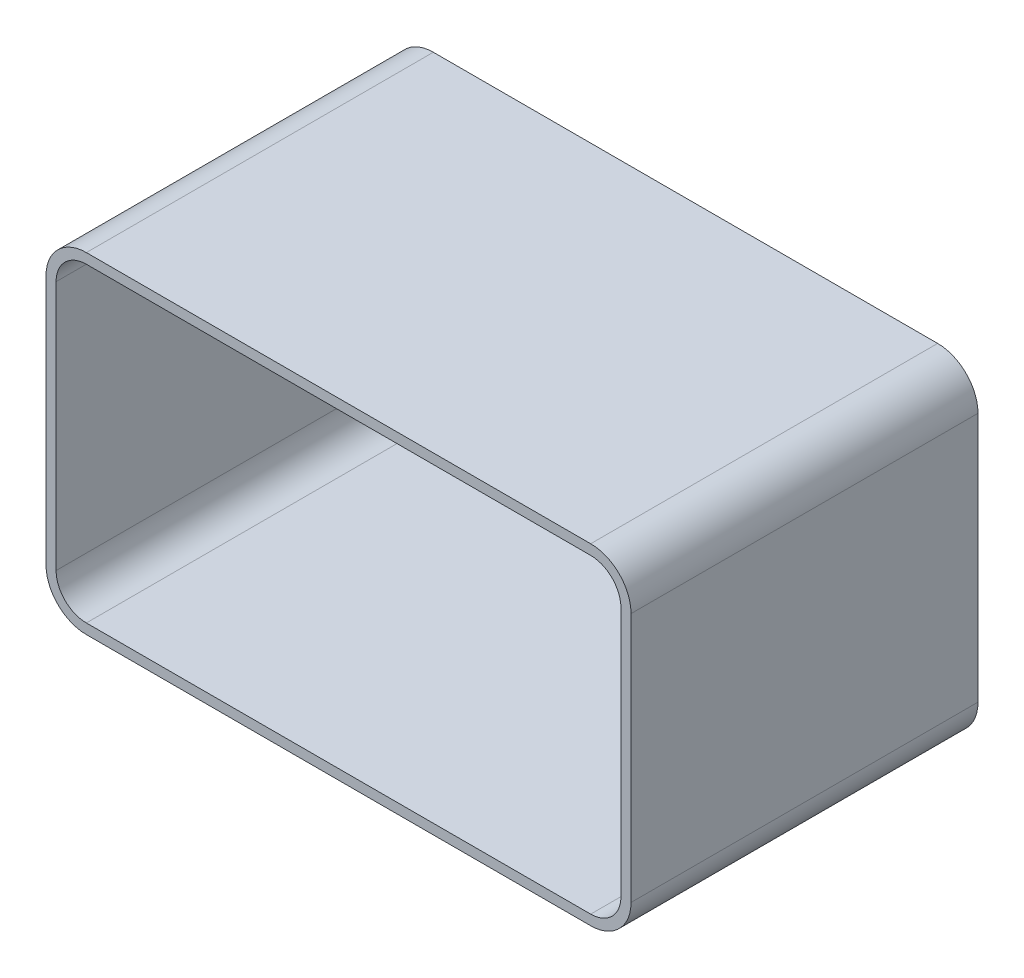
ISO-10303-21;
HEADER;
FILE_DESCRIPTION(('STEP AP214'),'2;1');
FILE_NAME('part.step','',(''),(''),'','','');
FILE_SCHEMA(('AUTOMOTIVE_DESIGN { 1 0 10303 214 1 1 1 1 }'));
ENDSEC;
DATA;
#1=APPLICATION_CONTEXT('core data for automotive mechanical design processes');
#2=APPLICATION_PROTOCOL_DEFINITION('international standard','automotive_design',2000,#1);
#3=PRODUCT_CONTEXT('',#1,'mechanical');
#4=PRODUCT('Part','Part','',(#3));
#5=PRODUCT_RELATED_PRODUCT_CATEGORY('part','',(#4));
#6=PRODUCT_DEFINITION_FORMATION('','',#4);
#7=PRODUCT_DEFINITION_CONTEXT('part definition',#1,'design');
#8=PRODUCT_DEFINITION('design','',#6,#7);
#9=PRODUCT_DEFINITION_SHAPE('','',#8);
#10=(LENGTH_UNIT() NAMED_UNIT(*) SI_UNIT(.MILLI.,.METRE.));
#11=(NAMED_UNIT(*) PLANE_ANGLE_UNIT() SI_UNIT($,.RADIAN.));
#12=(NAMED_UNIT(*) SI_UNIT($,.STERADIAN.) SOLID_ANGLE_UNIT());
#13=UNCERTAINTY_MEASURE_WITH_UNIT(LENGTH_MEASURE(1.E-05),#10,'distance_accuracy_value','');
#14=(GEOMETRIC_REPRESENTATION_CONTEXT(3) GLOBAL_UNCERTAINTY_ASSIGNED_CONTEXT((#13)) GLOBAL_UNIT_ASSIGNED_CONTEXT((#10,
#11,#12)) REPRESENTATION_CONTEXT('',''));
#15=CARTESIAN_POINT('',(0.,0.,0.));
#16=DIRECTION('',(0.,0.,1.));
#17=DIRECTION('',(1.,0.,0.));
#18=AXIS2_PLACEMENT_3D('',#15,#16,#17);
#19=CARTESIAN_POINT('',(0.,164.,0.));
#20=DIRECTION('',(0.,0.,-1.));
#21=DIRECTION('',(-1.,0.,0.));
#22=AXIS2_PLACEMENT_3D('',#19,#20,#21);
#23=PLANE('',#22);
#24=DIRECTION('',(-1.,0.,0.));
#25=VECTOR('',#24,1.);
#26=CARTESIAN_POINT('',(0.,164.,0.));
#27=LINE('',#26,#25);
#28=CARTESIAN_POINT('',(270.,164.,0.));
#29=VERTEX_POINT('',#28);
#30=CARTESIAN_POINT('',(20.,164.,0.));
#31=VERTEX_POINT('',#30);
#32=EDGE_CURVE('E227',#29,#31,#27,.T.);
#33=ORIENTED_EDGE('',*,*,#32,.T.);
#34=CARTESIAN_POINT('',(20.,144.,0.));
#35=DIRECTION('',(0.,0.,-1.));
#36=DIRECTION('',(-1.,0.,0.));
#37=AXIS2_PLACEMENT_3D('',#34,#35,#36);
#38=CIRCLE('',#37,20.);
#39=CARTESIAN_POINT('',(0.,144.,0.));
#40=VERTEX_POINT('',#39);
#41=EDGE_CURVE('E256',#31,#40,#38,.F.);
#42=ORIENTED_EDGE('',*,*,#41,.T.);
#43=DIRECTION('',(0.,-1.,0.));
#44=VECTOR('',#43,1.);
#45=CARTESIAN_POINT('',(0.,0.,0.));
#46=LINE('',#45,#44);
#47=CARTESIAN_POINT('',(0.,20.,0.));
#48=VERTEX_POINT('',#47);
#49=EDGE_CURVE('E206',#40,#48,#46,.T.);
#50=ORIENTED_EDGE('',*,*,#49,.T.);
#51=CARTESIAN_POINT('',(20.,20.,0.));
#52=DIRECTION('',(0.,0.,-1.));
#53=DIRECTION('',(-1.,0.,0.));
#54=AXIS2_PLACEMENT_3D('',#51,#52,#53);
#55=CIRCLE('',#54,20.);
#56=CARTESIAN_POINT('',(20.,0.,0.));
#57=VERTEX_POINT('',#56);
#58=EDGE_CURVE('E254',#48,#57,#55,.F.);
#59=ORIENTED_EDGE('',*,*,#58,.T.);
#60=DIRECTION('',(1.,0.,0.));
#61=VECTOR('',#60,1.);
#62=CARTESIAN_POINT('',(0.,0.,0.));
#63=LINE('',#62,#61);
#64=CARTESIAN_POINT('',(270.,0.,0.));
#65=VERTEX_POINT('',#64);
#66=EDGE_CURVE('E238',#57,#65,#63,.T.);
#67=ORIENTED_EDGE('',*,*,#66,.T.);
#68=CARTESIAN_POINT('',(270.,20.,0.));
#69=DIRECTION('',(0.,0.,-1.));
#70=DIRECTION('',(-1.,0.,0.));
#71=AXIS2_PLACEMENT_3D('',#68,#69,#70);
#72=CIRCLE('',#71,20.);
#73=CARTESIAN_POINT('',(290.,20.,0.));
#74=VERTEX_POINT('',#73);
#75=EDGE_CURVE('E252',#65,#74,#72,.F.);
#76=ORIENTED_EDGE('',*,*,#75,.T.);
#77=DIRECTION('',(0.,1.,0.));
#78=VECTOR('',#77,1.);
#79=CARTESIAN_POINT('',(290.,0.,0.));
#80=LINE('',#79,#78);
#81=CARTESIAN_POINT('',(290.,144.,0.));
#82=VERTEX_POINT('',#81);
#83=EDGE_CURVE('E241',#74,#82,#80,.T.);
#84=ORIENTED_EDGE('',*,*,#83,.T.);
#85=CARTESIAN_POINT('',(270.,144.,0.));
#86=DIRECTION('',(0.,0.,-1.));
#87=DIRECTION('',(-1.,0.,0.));
#88=AXIS2_PLACEMENT_3D('',#85,#86,#87);
#89=CIRCLE('',#88,20.);
#90=EDGE_CURVE('E250',#82,#29,#89,.F.);
#91=ORIENTED_EDGE('',*,*,#90,.T.);
#92=EDGE_LOOP('',(#33,#42,#50,#59,#67,#76,#84,#91));
#93=FACE_BOUND('',#92,.T.);
#94=DIRECTION('',(-1.,0.,0.));
#95=VECTOR('',#94,1.);
#96=CARTESIAN_POINT('',(0.,159.,0.));
#97=LINE('',#96,#95);
#98=CARTESIAN_POINT('',(270.,159.,0.));
#99=VERTEX_POINT('',#98);
#100=CARTESIAN_POINT('',(20.,159.,0.));
#101=VERTEX_POINT('',#100);
#102=EDGE_CURVE('E174',#99,#101,#97,.T.);
#103=ORIENTED_EDGE('',*,*,#102,.F.);
#104=CARTESIAN_POINT('',(270.,144.,0.));
#105=DIRECTION('',(0.,0.,-1.));
#106=DIRECTION('',(-1.,0.,0.));
#107=AXIS2_PLACEMENT_3D('',#104,#105,#106);
#108=CIRCLE('',#107,15.);
#109=CARTESIAN_POINT('',(285.,144.,0.));
#110=VERTEX_POINT('',#109);
#111=EDGE_CURVE('E201',#110,#99,#108,.F.);
#112=ORIENTED_EDGE('',*,*,#111,.F.);
#113=DIRECTION('',(0.,1.,0.));
#114=VECTOR('',#113,1.);
#115=CARTESIAN_POINT('',(285.,0.,0.));
#116=LINE('',#115,#114);
#117=CARTESIAN_POINT('',(285.,20.,0.));
#118=VERTEX_POINT('',#117);
#119=EDGE_CURVE('E53',#118,#110,#116,.T.);
#120=ORIENTED_EDGE('',*,*,#119,.F.);
#121=CARTESIAN_POINT('',(270.,20.,0.));
#122=DIRECTION('',(0.,0.,-1.));
#123=DIRECTION('',(-1.,0.,0.));
#124=AXIS2_PLACEMENT_3D('',#121,#122,#123);
#125=CIRCLE('',#124,15.);
#126=CARTESIAN_POINT('',(270.,5.,0.));
#127=VERTEX_POINT('',#126);
#128=EDGE_CURVE('E214',#127,#118,#125,.F.);
#129=ORIENTED_EDGE('',*,*,#128,.F.);
#130=DIRECTION('',(1.,0.,0.));
#131=VECTOR('',#130,1.);
#132=CARTESIAN_POINT('',(0.,5.,0.));
#133=LINE('',#132,#131);
#134=CARTESIAN_POINT('',(20.,5.,0.));
#135=VERTEX_POINT('',#134);
#136=EDGE_CURVE('E211',#135,#127,#133,.T.);
#137=ORIENTED_EDGE('',*,*,#136,.F.);
#138=CARTESIAN_POINT('',(20.,20.,0.));
#139=DIRECTION('',(0.,0.,-1.));
#140=DIRECTION('',(-1.,0.,0.));
#141=AXIS2_PLACEMENT_3D('',#138,#139,#140);
#142=CIRCLE('',#141,15.);
#143=CARTESIAN_POINT('',(5.,20.,0.));
#144=VERTEX_POINT('',#143);
#145=EDGE_CURVE('E212',#144,#135,#142,.F.);
#146=ORIENTED_EDGE('',*,*,#145,.F.);
#147=DIRECTION('',(0.,-1.,0.));
#148=VECTOR('',#147,1.);
#149=CARTESIAN_POINT('',(5.,0.,0.));
#150=LINE('',#149,#148);
#151=CARTESIAN_POINT('',(5.,144.,0.));
#152=VERTEX_POINT('',#151);
#153=EDGE_CURVE('E209',#152,#144,#150,.T.);
#154=ORIENTED_EDGE('',*,*,#153,.F.);
#155=CARTESIAN_POINT('',(20.,144.,0.));
#156=DIRECTION('',(0.,0.,-1.));
#157=DIRECTION('',(-1.,0.,0.));
#158=AXIS2_PLACEMENT_3D('',#155,#156,#157);
#159=CIRCLE('',#158,15.);
#160=EDGE_CURVE('E160',#101,#152,#159,.F.);
#161=ORIENTED_EDGE('',*,*,#160,.F.);
#162=EDGE_LOOP('',(#103,#112,#120,#129,#137,#146,#154,#161));
#163=FACE_BOUND('',#162,.T.);
#164=ADVANCED_FACE('F38',(#93,#163),#23,.F.);
#165=CARTESIAN_POINT('',(0.,0.,-172.));
#166=DIRECTION('',(-1.,0.,0.));
#167=DIRECTION('',(0.,0.,1.));
#168=AXIS2_PLACEMENT_3D('',#165,#166,#167);
#169=PLANE('',#168);
#170=ORIENTED_EDGE('',*,*,#49,.F.);
#171=DIRECTION('',(0.,0.,1.));
#172=VECTOR('',#171,1.);
#173=CARTESIAN_POINT('',(0.,144.,-172.));
#174=LINE('',#173,#172);
#175=CARTESIAN_POINT('',(0.,144.,-172.));
#176=VERTEX_POINT('',#175);
#177=EDGE_CURVE('E261',#40,#176,#174,.F.);
#178=ORIENTED_EDGE('',*,*,#177,.T.);
#179=DIRECTION('',(0.,-1.,0.));
#180=VECTOR('',#179,1.);
#181=CARTESIAN_POINT('',(0.,0.,-172.));
#182=LINE('',#181,#180);
#183=CARTESIAN_POINT('',(0.,20.,-172.));
#184=VERTEX_POINT('',#183);
#185=EDGE_CURVE('E223',#176,#184,#182,.T.);
#186=ORIENTED_EDGE('',*,*,#185,.T.);
#187=DIRECTION('',(0.,0.,1.));
#188=VECTOR('',#187,1.);
#189=CARTESIAN_POINT('',(0.,20.,-172.));
#190=LINE('',#189,#188);
#191=EDGE_CURVE('E258',#184,#48,#190,.T.);
#192=ORIENTED_EDGE('',*,*,#191,.T.);
#193=EDGE_LOOP('',(#170,#178,#186,#192));
#194=FACE_BOUND('',#193,.T.);
#195=ADVANCED_FACE('F300',(#194),#169,.T.);
#196=CARTESIAN_POINT('',(0.,164.,-172.));
#197=DIRECTION('',(0.,1.,0.));
#198=DIRECTION('',(0.,0.,1.));
#199=AXIS2_PLACEMENT_3D('',#196,#197,#198);
#200=PLANE('',#199);
#201=DIRECTION('',(-1.,0.,0.));
#202=VECTOR('',#201,1.);
#203=CARTESIAN_POINT('',(0.,164.,-172.));
#204=LINE('',#203,#202);
#205=CARTESIAN_POINT('',(270.,164.,-172.));
#206=VERTEX_POINT('',#205);
#207=CARTESIAN_POINT('',(20.,164.,-172.));
#208=VERTEX_POINT('',#207);
#209=EDGE_CURVE('E232',#206,#208,#204,.T.);
#210=ORIENTED_EDGE('',*,*,#209,.T.);
#211=DIRECTION('',(0.,0.,1.));
#212=VECTOR('',#211,1.);
#213=CARTESIAN_POINT('',(20.,164.,-172.));
#214=LINE('',#213,#212);
#215=EDGE_CURVE('E247',#208,#31,#214,.T.);
#216=ORIENTED_EDGE('',*,*,#215,.T.);
#217=ORIENTED_EDGE('',*,*,#32,.F.);
#218=DIRECTION('',(0.,0.,1.));
#219=VECTOR('',#218,1.);
#220=CARTESIAN_POINT('',(270.,164.,-172.));
#221=LINE('',#220,#219);
#222=EDGE_CURVE('E235',#29,#206,#221,.F.);
#223=ORIENTED_EDGE('',*,*,#222,.T.);
#224=EDGE_LOOP('',(#210,#216,#217,#223));
#225=FACE_BOUND('',#224,.T.);
#226=ADVANCED_FACE('F307',(#225),#200,.T.);
#227=CARTESIAN_POINT('',(290.,0.,-172.));
#228=DIRECTION('',(1.,0.,0.));
#229=DIRECTION('',(0.,0.,-1.));
#230=AXIS2_PLACEMENT_3D('',#227,#228,#229);
#231=PLANE('',#230);
#232=ORIENTED_EDGE('',*,*,#83,.F.);
#233=DIRECTION('',(0.,0.,1.));
#234=VECTOR('',#233,1.);
#235=CARTESIAN_POINT('',(290.,20.,-172.));
#236=LINE('',#235,#234);
#237=CARTESIAN_POINT('',(290.,20.,-172.));
#238=VERTEX_POINT('',#237);
#239=EDGE_CURVE('E11',#74,#238,#236,.F.);
#240=ORIENTED_EDGE('',*,*,#239,.T.);
#241=DIRECTION('',(0.,1.,0.));
#242=VECTOR('',#241,1.);
#243=CARTESIAN_POINT('',(290.,0.,-172.));
#244=LINE('',#243,#242);
#245=CARTESIAN_POINT('',(290.,144.,-172.));
#246=VERTEX_POINT('',#245);
#247=EDGE_CURVE('E229',#238,#246,#244,.T.);
#248=ORIENTED_EDGE('',*,*,#247,.T.);
#249=DIRECTION('',(0.,0.,1.));
#250=VECTOR('',#249,1.);
#251=CARTESIAN_POINT('',(290.,144.,-172.));
#252=LINE('',#251,#250);
#253=EDGE_CURVE('E46',#246,#82,#252,.T.);
#254=ORIENTED_EDGE('',*,*,#253,.T.);
#255=EDGE_LOOP('',(#232,#240,#248,#254));
#256=FACE_BOUND('',#255,.T.);
#257=ADVANCED_FACE('F278',(#256),#231,.T.);
#258=CARTESIAN_POINT('',(0.,0.,-172.));
#259=DIRECTION('',(0.,-1.,0.));
#260=DIRECTION('',(0.,0.,-1.));
#261=AXIS2_PLACEMENT_3D('',#258,#259,#260);
#262=PLANE('',#261);
#263=ORIENTED_EDGE('',*,*,#66,.F.);
#264=DIRECTION('',(0.,0.,1.));
#265=VECTOR('',#264,1.);
#266=CARTESIAN_POINT('',(20.,0.,-172.));
#267=LINE('',#266,#265);
#268=CARTESIAN_POINT('',(20.,0.,-172.));
#269=VERTEX_POINT('',#268);
#270=EDGE_CURVE('E273',#57,#269,#267,.F.);
#271=ORIENTED_EDGE('',*,*,#270,.T.);
#272=DIRECTION('',(1.,0.,0.));
#273=VECTOR('',#272,1.);
#274=CARTESIAN_POINT('',(0.,0.,-172.));
#275=LINE('',#274,#273);
#276=CARTESIAN_POINT('',(270.,0.,-172.));
#277=VERTEX_POINT('',#276);
#278=EDGE_CURVE('E226',#269,#277,#275,.T.);
#279=ORIENTED_EDGE('',*,*,#278,.T.);
#280=DIRECTION('',(0.,0.,1.));
#281=VECTOR('',#280,1.);
#282=CARTESIAN_POINT('',(270.,0.,-172.));
#283=LINE('',#282,#281);
#284=EDGE_CURVE('E270',#277,#65,#283,.T.);
#285=ORIENTED_EDGE('',*,*,#284,.T.);
#286=EDGE_LOOP('',(#263,#271,#279,#285));
#287=FACE_BOUND('',#286,.T.);
#288=ADVANCED_FACE('F290',(#287),#262,.T.);
#289=CARTESIAN_POINT('',(0.,164.,-172.));
#290=DIRECTION('',(0.,0.,-1.));
#291=DIRECTION('',(-1.,0.,0.));
#292=AXIS2_PLACEMENT_3D('',#289,#290,#291);
#293=PLANE('',#292);
#294=ORIENTED_EDGE('',*,*,#185,.F.);
#295=CARTESIAN_POINT('',(20.,144.,-172.));
#296=DIRECTION('',(0.,0.,-1.));
#297=DIRECTION('',(-1.,0.,0.));
#298=AXIS2_PLACEMENT_3D('',#295,#296,#297);
#299=CIRCLE('',#298,20.);
#300=EDGE_CURVE('E268',#176,#208,#299,.T.);
#301=ORIENTED_EDGE('',*,*,#300,.T.);
#302=ORIENTED_EDGE('',*,*,#209,.F.);
#303=CARTESIAN_POINT('',(270.,144.,-172.));
#304=DIRECTION('',(0.,0.,-1.));
#305=DIRECTION('',(-1.,0.,0.));
#306=AXIS2_PLACEMENT_3D('',#303,#304,#305);
#307=CIRCLE('',#306,20.);
#308=EDGE_CURVE('E263',#206,#246,#307,.T.);
#309=ORIENTED_EDGE('',*,*,#308,.T.);
#310=ORIENTED_EDGE('',*,*,#247,.F.);
#311=CARTESIAN_POINT('',(270.,20.,-172.));
#312=DIRECTION('',(0.,0.,-1.));
#313=DIRECTION('',(-1.,0.,0.));
#314=AXIS2_PLACEMENT_3D('',#311,#312,#313);
#315=CIRCLE('',#314,20.);
#316=EDGE_CURVE('E61',#238,#277,#315,.T.);
#317=ORIENTED_EDGE('',*,*,#316,.T.);
#318=ORIENTED_EDGE('',*,*,#278,.F.);
#319=CARTESIAN_POINT('',(20.,20.,-172.));
#320=DIRECTION('',(0.,0.,-1.));
#321=DIRECTION('',(-1.,0.,0.));
#322=AXIS2_PLACEMENT_3D('',#319,#320,#321);
#323=CIRCLE('',#322,20.);
#324=EDGE_CURVE('E266',#269,#184,#323,.T.);
#325=ORIENTED_EDGE('',*,*,#324,.T.);
#326=EDGE_LOOP('',(#294,#301,#302,#309,#310,#317,#318,#325));
#327=FACE_BOUND('',#326,.T.);
#328=ADVANCED_FACE('F294',(#327),#293,.T.);
#329=CARTESIAN_POINT('',(20.,144.,-172.));
#330=DIRECTION('',(0.,0.,1.));
#331=DIRECTION('',(1.,0.,0.));
#332=AXIS2_PLACEMENT_3D('',#329,#330,#331);
#333=CYLINDRICAL_SURFACE('',#332,20.);
#334=ORIENTED_EDGE('',*,*,#300,.F.);
#335=ORIENTED_EDGE('',*,*,#177,.F.);
#336=ORIENTED_EDGE('',*,*,#41,.F.);
#337=ORIENTED_EDGE('',*,*,#215,.F.);
#338=EDGE_LOOP('',(#334,#335,#336,#337));
#339=FACE_BOUND('',#338,.T.);
#340=ADVANCED_FACE('F305',(#339),#333,.T.);
#341=CARTESIAN_POINT('',(20.,20.,-172.));
#342=DIRECTION('',(0.,0.,1.));
#343=DIRECTION('',(1.,0.,0.));
#344=AXIS2_PLACEMENT_3D('',#341,#342,#343);
#345=CYLINDRICAL_SURFACE('',#344,20.);
#346=ORIENTED_EDGE('',*,*,#324,.F.);
#347=ORIENTED_EDGE('',*,*,#270,.F.);
#348=ORIENTED_EDGE('',*,*,#58,.F.);
#349=ORIENTED_EDGE('',*,*,#191,.F.);
#350=EDGE_LOOP('',(#346,#347,#348,#349));
#351=FACE_BOUND('',#350,.T.);
#352=ADVANCED_FACE('F297',(#351),#345,.T.);
#353=CARTESIAN_POINT('',(270.,20.,-172.));
#354=DIRECTION('',(0.,0.,1.));
#355=DIRECTION('',(1.,0.,0.));
#356=AXIS2_PLACEMENT_3D('',#353,#354,#355);
#357=CYLINDRICAL_SURFACE('',#356,20.);
#358=ORIENTED_EDGE('',*,*,#316,.F.);
#359=ORIENTED_EDGE('',*,*,#239,.F.);
#360=ORIENTED_EDGE('',*,*,#75,.F.);
#361=ORIENTED_EDGE('',*,*,#284,.F.);
#362=EDGE_LOOP('',(#358,#359,#360,#361));
#363=FACE_BOUND('',#362,.T.);
#364=ADVANCED_FACE('F288',(#363),#357,.T.);
#365=CARTESIAN_POINT('',(270.,144.,-172.));
#366=DIRECTION('',(0.,0.,1.));
#367=DIRECTION('',(1.,0.,0.));
#368=AXIS2_PLACEMENT_3D('',#365,#366,#367);
#369=CYLINDRICAL_SURFACE('',#368,20.);
#370=ORIENTED_EDGE('',*,*,#308,.F.);
#371=ORIENTED_EDGE('',*,*,#222,.F.);
#372=ORIENTED_EDGE('',*,*,#90,.F.);
#373=ORIENTED_EDGE('',*,*,#253,.F.);
#374=EDGE_LOOP('',(#370,#371,#372,#373));
#375=FACE_BOUND('',#374,.T.);
#376=ADVANCED_FACE('F40',(#375),#369,.T.);
#377=CARTESIAN_POINT('',(5.,0.,-172.));
#378=DIRECTION('',(-1.,0.,0.));
#379=DIRECTION('',(0.,0.,1.));
#380=AXIS2_PLACEMENT_3D('',#377,#378,#379);
#381=PLANE('',#380);
#382=ORIENTED_EDGE('',*,*,#153,.T.);
#383=DIRECTION('',(0.,0.,1.));
#384=VECTOR('',#383,1.);
#385=CARTESIAN_POINT('',(5.,20.,-172.));
#386=LINE('',#385,#384);
#387=CARTESIAN_POINT('',(5.,20.,-167.));
#388=VERTEX_POINT('',#387);
#389=EDGE_CURVE('E165',#388,#144,#386,.T.);
#390=ORIENTED_EDGE('',*,*,#389,.F.);
#391=DIRECTION('',(0.,-1.,0.));
#392=VECTOR('',#391,1.);
#393=CARTESIAN_POINT('',(5.,0.,-167.));
#394=LINE('',#393,#392);
#395=CARTESIAN_POINT('',(5.,144.,-167.));
#396=VERTEX_POINT('',#395);
#397=EDGE_CURVE('E169',#396,#388,#394,.T.);
#398=ORIENTED_EDGE('',*,*,#397,.F.);
#399=DIRECTION('',(0.,0.,1.));
#400=VECTOR('',#399,1.);
#401=CARTESIAN_POINT('',(5.,144.,-172.));
#402=LINE('',#401,#400);
#403=EDGE_CURVE('E153',#152,#396,#402,.F.);
#404=ORIENTED_EDGE('',*,*,#403,.F.);
#405=EDGE_LOOP('',(#382,#390,#398,#404));
#406=FACE_BOUND('',#405,.T.);
#407=ADVANCED_FACE('F170',(#406),#381,.F.);
#408=CARTESIAN_POINT('',(0.,159.,-172.));
#409=DIRECTION('',(0.,1.,0.));
#410=DIRECTION('',(0.,0.,1.));
#411=AXIS2_PLACEMENT_3D('',#408,#409,#410);
#412=PLANE('',#411);
#413=DIRECTION('',(-1.,0.,0.));
#414=VECTOR('',#413,1.);
#415=CARTESIAN_POINT('',(0.,159.,-167.));
#416=LINE('',#415,#414);
#417=CARTESIAN_POINT('',(270.,159.,-167.));
#418=VERTEX_POINT('',#417);
#419=CARTESIAN_POINT('',(20.,159.,-167.));
#420=VERTEX_POINT('',#419);
#421=EDGE_CURVE('E179',#418,#420,#416,.T.);
#422=ORIENTED_EDGE('',*,*,#421,.F.);
#423=DIRECTION('',(0.,0.,1.));
#424=VECTOR('',#423,1.);
#425=CARTESIAN_POINT('',(270.,159.,-172.));
#426=LINE('',#425,#424);
#427=EDGE_CURVE('E191',#99,#418,#426,.F.);
#428=ORIENTED_EDGE('',*,*,#427,.F.);
#429=ORIENTED_EDGE('',*,*,#102,.T.);
#430=DIRECTION('',(0.,0.,1.));
#431=VECTOR('',#430,1.);
#432=CARTESIAN_POINT('',(20.,159.,-172.));
#433=LINE('',#432,#431);
#434=EDGE_CURVE('E199',#420,#101,#433,.T.);
#435=ORIENTED_EDGE('',*,*,#434,.F.);
#436=EDGE_LOOP('',(#422,#428,#429,#435));
#437=FACE_BOUND('',#436,.T.);
#438=ADVANCED_FACE('F315',(#437),#412,.F.);
#439=CARTESIAN_POINT('',(285.,0.,-172.));
#440=DIRECTION('',(1.,0.,0.));
#441=DIRECTION('',(0.,0.,-1.));
#442=AXIS2_PLACEMENT_3D('',#439,#440,#441);
#443=PLANE('',#442);
#444=ORIENTED_EDGE('',*,*,#119,.T.);
#445=DIRECTION('',(0.,0.,-1.));
#446=VECTOR('',#445,1.);
#447=CARTESIAN_POINT('',(285.,144.,-172.));
#448=LINE('',#447,#446);
#449=CARTESIAN_POINT('',(285.,144.,-167.));
#450=VERTEX_POINT('',#449);
#451=EDGE_CURVE('E203',#450,#110,#448,.F.);
#452=ORIENTED_EDGE('',*,*,#451,.F.);
#453=DIRECTION('',(0.,1.,0.));
#454=VECTOR('',#453,1.);
#455=CARTESIAN_POINT('',(285.,0.,-167.));
#456=LINE('',#455,#454);
#457=CARTESIAN_POINT('',(285.,20.,-167.));
#458=VERTEX_POINT('',#457);
#459=EDGE_CURVE('E192',#458,#450,#456,.T.);
#460=ORIENTED_EDGE('',*,*,#459,.F.);
#461=DIRECTION('',(0.,0.,-1.));
#462=VECTOR('',#461,1.);
#463=CARTESIAN_POINT('',(285.,20.,-172.));
#464=LINE('',#463,#462);
#465=EDGE_CURVE('E205',#118,#458,#464,.T.);
#466=ORIENTED_EDGE('',*,*,#465,.F.);
#467=EDGE_LOOP('',(#444,#452,#460,#466));
#468=FACE_BOUND('',#467,.T.);
#469=ADVANCED_FACE('F359',(#468),#443,.F.);
#470=CARTESIAN_POINT('',(0.,5.,-172.));
#471=DIRECTION('',(0.,-1.,0.));
#472=DIRECTION('',(0.,0.,-1.));
#473=AXIS2_PLACEMENT_3D('',#470,#471,#472);
#474=PLANE('',#473);
#475=ORIENTED_EDGE('',*,*,#136,.T.);
#476=DIRECTION('',(0.,0.,-1.));
#477=VECTOR('',#476,1.);
#478=CARTESIAN_POINT('',(270.,5.,-172.));
#479=LINE('',#478,#477);
#480=CARTESIAN_POINT('',(270.,5.,-167.));
#481=VERTEX_POINT('',#480);
#482=EDGE_CURVE('E181',#481,#127,#479,.F.);
#483=ORIENTED_EDGE('',*,*,#482,.F.);
#484=DIRECTION('',(1.,0.,0.));
#485=VECTOR('',#484,1.);
#486=CARTESIAN_POINT('',(0.,5.,-167.));
#487=LINE('',#486,#485);
#488=CARTESIAN_POINT('',(20.,5.,-167.));
#489=VERTEX_POINT('',#488);
#490=EDGE_CURVE('E173',#489,#481,#487,.T.);
#491=ORIENTED_EDGE('',*,*,#490,.F.);
#492=DIRECTION('',(0.,0.,-1.));
#493=VECTOR('',#492,1.);
#494=CARTESIAN_POINT('',(20.,5.,-172.));
#495=LINE('',#494,#493);
#496=EDGE_CURVE('E184',#135,#489,#495,.T.);
#497=ORIENTED_EDGE('',*,*,#496,.F.);
#498=EDGE_LOOP('',(#475,#483,#491,#497));
#499=FACE_BOUND('',#498,.T.);
#500=ADVANCED_FACE('F368',(#499),#474,.F.);
#501=CARTESIAN_POINT('',(0.,164.,-167.));
#502=DIRECTION('',(0.,0.,-1.));
#503=DIRECTION('',(-1.,0.,0.));
#504=AXIS2_PLACEMENT_3D('',#501,#502,#503);
#505=PLANE('',#504);
#506=ORIENTED_EDGE('',*,*,#397,.T.);
#507=CARTESIAN_POINT('',(20.,20.,-167.));
#508=DIRECTION('',(0.,0.,-1.));
#509=DIRECTION('',(-1.,0.,0.));
#510=AXIS2_PLACEMENT_3D('',#507,#508,#509);
#511=CIRCLE('',#510,15.);
#512=EDGE_CURVE('E182',#489,#388,#511,.T.);
#513=ORIENTED_EDGE('',*,*,#512,.F.);
#514=ORIENTED_EDGE('',*,*,#490,.T.);
#515=CARTESIAN_POINT('',(270.,20.,-167.));
#516=DIRECTION('',(0.,0.,-1.));
#517=DIRECTION('',(-1.,0.,0.));
#518=AXIS2_PLACEMENT_3D('',#515,#516,#517);
#519=CIRCLE('',#518,15.);
#520=EDGE_CURVE('E186',#458,#481,#519,.T.);
#521=ORIENTED_EDGE('',*,*,#520,.F.);
#522=ORIENTED_EDGE('',*,*,#459,.T.);
#523=CARTESIAN_POINT('',(270.,144.,-167.));
#524=DIRECTION('',(0.,0.,-1.));
#525=DIRECTION('',(-1.,0.,0.));
#526=AXIS2_PLACEMENT_3D('',#523,#524,#525);
#527=CIRCLE('',#526,15.);
#528=EDGE_CURVE('E164',#418,#450,#527,.T.);
#529=ORIENTED_EDGE('',*,*,#528,.F.);
#530=ORIENTED_EDGE('',*,*,#421,.T.);
#531=CARTESIAN_POINT('',(20.,144.,-167.));
#532=DIRECTION('',(0.,0.,-1.));
#533=DIRECTION('',(-1.,0.,0.));
#534=AXIS2_PLACEMENT_3D('',#531,#532,#533);
#535=CIRCLE('',#534,15.);
#536=EDGE_CURVE('E157',#396,#420,#535,.T.);
#537=ORIENTED_EDGE('',*,*,#536,.F.);
#538=EDGE_LOOP('',(#506,#513,#514,#521,#522,#529,#530,#537));
#539=FACE_BOUND('',#538,.T.);
#540=ADVANCED_FACE('F176',(#539),#505,.F.);
#541=CARTESIAN_POINT('',(20.,144.,-172.));
#542=DIRECTION('',(0.,0.,1.));
#543=DIRECTION('',(1.,0.,0.));
#544=AXIS2_PLACEMENT_3D('',#541,#542,#543);
#545=CYLINDRICAL_SURFACE('',#544,15.);
#546=ORIENTED_EDGE('',*,*,#536,.T.);
#547=ORIENTED_EDGE('',*,*,#434,.T.);
#548=ORIENTED_EDGE('',*,*,#160,.T.);
#549=ORIENTED_EDGE('',*,*,#403,.T.);
#550=EDGE_LOOP('',(#546,#547,#548,#549));
#551=FACE_BOUND('',#550,.T.);
#552=ADVANCED_FACE('F155',(#551),#545,.F.);
#553=CARTESIAN_POINT('',(20.,20.,-172.));
#554=DIRECTION('',(0.,0.,1.));
#555=DIRECTION('',(1.,0.,0.));
#556=AXIS2_PLACEMENT_3D('',#553,#554,#555);
#557=CYLINDRICAL_SURFACE('',#556,15.);
#558=ORIENTED_EDGE('',*,*,#512,.T.);
#559=ORIENTED_EDGE('',*,*,#389,.T.);
#560=ORIENTED_EDGE('',*,*,#145,.T.);
#561=ORIENTED_EDGE('',*,*,#496,.T.);
#562=EDGE_LOOP('',(#558,#559,#560,#561));
#563=FACE_BOUND('',#562,.T.);
#564=ADVANCED_FACE('F385',(#563),#557,.F.);
#565=CARTESIAN_POINT('',(270.,20.,-172.));
#566=DIRECTION('',(0.,0.,1.));
#567=DIRECTION('',(1.,0.,0.));
#568=AXIS2_PLACEMENT_3D('',#565,#566,#567);
#569=CYLINDRICAL_SURFACE('',#568,15.);
#570=ORIENTED_EDGE('',*,*,#520,.T.);
#571=ORIENTED_EDGE('',*,*,#482,.T.);
#572=ORIENTED_EDGE('',*,*,#128,.T.);
#573=ORIENTED_EDGE('',*,*,#465,.T.);
#574=EDGE_LOOP('',(#570,#571,#572,#573));
#575=FACE_BOUND('',#574,.T.);
#576=ADVANCED_FACE('F393',(#575),#569,.F.);
#577=CARTESIAN_POINT('',(270.,144.,-172.));
#578=DIRECTION('',(0.,0.,1.));
#579=DIRECTION('',(1.,0.,0.));
#580=AXIS2_PLACEMENT_3D('',#577,#578,#579);
#581=CYLINDRICAL_SURFACE('',#580,15.);
#582=ORIENTED_EDGE('',*,*,#528,.T.);
#583=ORIENTED_EDGE('',*,*,#451,.T.);
#584=ORIENTED_EDGE('',*,*,#111,.T.);
#585=ORIENTED_EDGE('',*,*,#427,.T.);
#586=EDGE_LOOP('',(#582,#583,#584,#585));
#587=FACE_BOUND('',#586,.T.);
#588=ADVANCED_FACE('F402',(#587),#581,.F.);
#589=CLOSED_SHELL('',(#164,#195,#226,#257,#288,#328,#340,#352,#364,#376,#407,#438,#469,#500,
#540,#552,#564,#576,#588));
#590=MANIFOLD_SOLID_BREP('B2',#589);
#591=ADVANCED_BREP_SHAPE_REPRESENTATION('',(#18,#590),#14);
#592=SHAPE_DEFINITION_REPRESENTATION(#9,#591);
ENDSEC;
END-ISO-10303-21;
